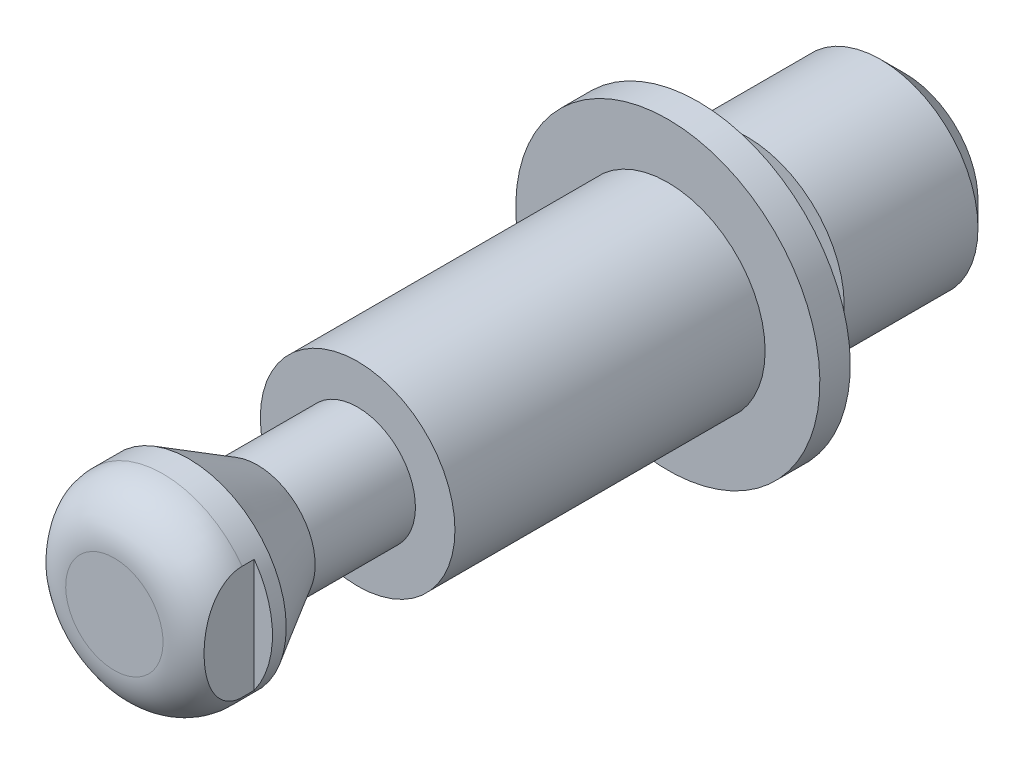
ISO-10303-21;
HEADER;
FILE_DESCRIPTION(('STEP AP214'),'2;1');
FILE_NAME('part.step','',(''),(''),'','','');
FILE_SCHEMA(('AUTOMOTIVE_DESIGN { 1 0 10303 214 1 1 1 1 }'));
ENDSEC;
DATA;
#1=APPLICATION_CONTEXT('core data for automotive mechanical design processes');
#2=APPLICATION_PROTOCOL_DEFINITION('international standard','automotive_design',2000,#1);
#3=PRODUCT_CONTEXT('',#1,'mechanical');
#4=PRODUCT('Part','Part','',(#3));
#5=PRODUCT_RELATED_PRODUCT_CATEGORY('part','',(#4));
#6=PRODUCT_DEFINITION_FORMATION('','',#4);
#7=PRODUCT_DEFINITION_CONTEXT('part definition',#1,'design');
#8=PRODUCT_DEFINITION('design','',#6,#7);
#9=PRODUCT_DEFINITION_SHAPE('','',#8);
#10=(LENGTH_UNIT() NAMED_UNIT(*) SI_UNIT(.MILLI.,.METRE.));
#11=(NAMED_UNIT(*) PLANE_ANGLE_UNIT() SI_UNIT($,.RADIAN.));
#12=(NAMED_UNIT(*) SI_UNIT($,.STERADIAN.) SOLID_ANGLE_UNIT());
#13=UNCERTAINTY_MEASURE_WITH_UNIT(LENGTH_MEASURE(1.E-05),#10,'distance_accuracy_value','');
#14=(GEOMETRIC_REPRESENTATION_CONTEXT(3) GLOBAL_UNCERTAINTY_ASSIGNED_CONTEXT((#13)) GLOBAL_UNIT_ASSIGNED_CONTEXT((#10,
#11,#12)) REPRESENTATION_CONTEXT('',''));
#15=CARTESIAN_POINT('',(0.,0.,0.));
#16=DIRECTION('',(0.,0.,1.));
#17=DIRECTION('',(1.,0.,0.));
#18=AXIS2_PLACEMENT_3D('',#15,#16,#17);
#19=CARTESIAN_POINT('',(0.,0.,0.));
#20=DIRECTION('',(0.,0.,-1.));
#21=DIRECTION('',(0.,-1.,0.));
#22=AXIS2_PLACEMENT_3D('',#19,#20,#21);
#23=PLANE('',#22);
#24=CARTESIAN_POINT('',(0.,0.,0.));
#25=DIRECTION('',(0.,0.,-1.));
#26=DIRECTION('',(-1.,0.,0.));
#27=AXIS2_PLACEMENT_3D('',#24,#25,#26);
#28=CIRCLE('',#27,6.5);
#29=CARTESIAN_POINT('',(-6.5,0.,0.));
#30=VERTEX_POINT('',#29);
#31=EDGE_CURVE('E82',#30,#30,#28,.T.);
#32=ORIENTED_EDGE('',*,*,#31,.F.);
#33=EDGE_LOOP('',(#32));
#34=FACE_BOUND('',#33,.T.);
#35=CARTESIAN_POINT('',(0.,0.,0.));
#36=DIRECTION('',(0.,0.,1.));
#37=DIRECTION('',(0.,1.,0.));
#38=AXIS2_PLACEMENT_3D('',#35,#36,#37);
#39=CIRCLE('',#38,12.5);
#40=CARTESIAN_POINT('',(0.,12.5,0.));
#41=VERTEX_POINT('',#40);
#42=EDGE_CURVE('E107',#41,#41,#39,.T.);
#43=ORIENTED_EDGE('',*,*,#42,.F.);
#44=EDGE_LOOP('',(#43));
#45=FACE_BOUND('',#44,.T.);
#46=ADVANCED_FACE('F14',(#34,#45),#23,.T.);
#47=CARTESIAN_POINT('',(0.,0.,0.));
#48=DIRECTION('',(0.,0.,1.));
#49=DIRECTION('',(0.,1.,0.));
#50=AXIS2_PLACEMENT_3D('',#47,#48,#49);
#51=CYLINDRICAL_SURFACE('',#50,12.5);
#52=ORIENTED_EDGE('',*,*,#42,.T.);
#53=EDGE_LOOP('',(#52));
#54=FACE_BOUND('',#53,.T.);
#55=CARTESIAN_POINT('',(0.,0.,2.5));
#56=DIRECTION('',(0.,0.,1.));
#57=DIRECTION('',(0.,1.,0.));
#58=AXIS2_PLACEMENT_3D('',#55,#56,#57);
#59=CIRCLE('',#58,12.5);
#60=CARTESIAN_POINT('',(0.,12.5,2.5));
#61=VERTEX_POINT('',#60);
#62=EDGE_CURVE('E104',#61,#61,#59,.T.);
#63=ORIENTED_EDGE('',*,*,#62,.F.);
#64=EDGE_LOOP('',(#63));
#65=FACE_BOUND('',#64,.T.);
#66=ADVANCED_FACE('F157',(#54,#65),#51,.T.);
#67=CARTESIAN_POINT('',(0.,12.5,2.5));
#68=DIRECTION('',(0.,0.,1.));
#69=DIRECTION('',(0.,1.,0.));
#70=AXIS2_PLACEMENT_3D('',#67,#68,#69);
#71=PLANE('',#70);
#72=ORIENTED_EDGE('',*,*,#62,.T.);
#73=EDGE_LOOP('',(#72));
#74=FACE_BOUND('',#73,.T.);
#75=CARTESIAN_POINT('',(0.,0.,2.5));
#76=DIRECTION('',(0.,0.,1.));
#77=DIRECTION('',(0.,1.,0.));
#78=AXIS2_PLACEMENT_3D('',#75,#76,#77);
#79=CIRCLE('',#78,8.);
#80=CARTESIAN_POINT('',(0.,8.,2.5));
#81=VERTEX_POINT('',#80);
#82=EDGE_CURVE('E101',#81,#81,#79,.T.);
#83=ORIENTED_EDGE('',*,*,#82,.F.);
#84=EDGE_LOOP('',(#83));
#85=FACE_BOUND('',#84,.T.);
#86=ADVANCED_FACE('F163',(#74,#85),#71,.T.);
#87=CARTESIAN_POINT('',(0.,0.,0.));
#88=DIRECTION('',(0.,0.,1.));
#89=DIRECTION('',(0.,1.,0.));
#90=AXIS2_PLACEMENT_3D('',#87,#88,#89);
#91=CYLINDRICAL_SURFACE('',#90,8.);
#92=ORIENTED_EDGE('',*,*,#82,.T.);
#93=EDGE_LOOP('',(#92));
#94=FACE_BOUND('',#93,.T.);
#95=CARTESIAN_POINT('',(0.,0.,28.));
#96=DIRECTION('',(0.,0.,1.));
#97=DIRECTION('',(0.,1.,0.));
#98=AXIS2_PLACEMENT_3D('',#95,#96,#97);
#99=CIRCLE('',#98,8.);
#100=CARTESIAN_POINT('',(0.,8.,28.));
#101=VERTEX_POINT('',#100);
#102=EDGE_CURVE('E98',#101,#101,#99,.T.);
#103=ORIENTED_EDGE('',*,*,#102,.F.);
#104=EDGE_LOOP('',(#103));
#105=FACE_BOUND('',#104,.T.);
#106=ADVANCED_FACE('F171',(#94,#105),#91,.T.);
#107=CARTESIAN_POINT('',(0.,4.75,28.));
#108=DIRECTION('',(0.,0.,1.));
#109=DIRECTION('',(0.,1.,0.));
#110=AXIS2_PLACEMENT_3D('',#107,#108,#109);
#111=PLANE('',#110);
#112=ORIENTED_EDGE('',*,*,#102,.T.);
#113=EDGE_LOOP('',(#112));
#114=FACE_BOUND('',#113,.T.);
#115=CARTESIAN_POINT('',(0.,0.,28.));
#116=DIRECTION('',(0.,0.,1.));
#117=DIRECTION('',(0.,1.,0.));
#118=AXIS2_PLACEMENT_3D('',#115,#116,#117);
#119=CIRCLE('',#118,4.75);
#120=CARTESIAN_POINT('',(0.,4.75,28.));
#121=VERTEX_POINT('',#120);
#122=EDGE_CURVE('E95',#121,#121,#119,.T.);
#123=ORIENTED_EDGE('',*,*,#122,.F.);
#124=EDGE_LOOP('',(#123));
#125=FACE_BOUND('',#124,.T.);
#126=ADVANCED_FACE('F175',(#114,#125),#111,.T.);
#127=CARTESIAN_POINT('',(0.,0.,0.));
#128=DIRECTION('',(0.,0.,1.));
#129=DIRECTION('',(0.,1.,0.));
#130=AXIS2_PLACEMENT_3D('',#127,#128,#129);
#131=CYLINDRICAL_SURFACE('',#130,4.75);
#132=ORIENTED_EDGE('',*,*,#122,.T.);
#133=EDGE_LOOP('',(#132));
#134=FACE_BOUND('',#133,.T.);
#135=CARTESIAN_POINT('',(0.,0.,36.24));
#136=DIRECTION('',(0.,0.,1.));
#137=DIRECTION('',(0.,1.,0.));
#138=AXIS2_PLACEMENT_3D('',#135,#136,#137);
#139=CIRCLE('',#138,4.75);
#140=CARTESIAN_POINT('',(0.,4.75,36.24));
#141=VERTEX_POINT('',#140);
#142=EDGE_CURVE('E92',#141,#141,#139,.T.);
#143=ORIENTED_EDGE('',*,*,#142,.F.);
#144=EDGE_LOOP('',(#143));
#145=FACE_BOUND('',#144,.T.);
#146=ADVANCED_FACE('F179',(#134,#145),#131,.T.);
#147=CARTESIAN_POINT('',(0.,0.,41.8691651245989));
#148=DIRECTION('',(0.,0.,1.));
#149=DIRECTION('',(0.,1.,0.));
#150=AXIS2_PLACEMENT_3D('',#147,#148,#149);
#151=CONICAL_SURFACE('',#150,8.,0.5235987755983);
#152=ORIENTED_EDGE('',*,*,#142,.T.);
#153=EDGE_LOOP('',(#152));
#154=FACE_BOUND('',#153,.T.);
#155=CARTESIAN_POINT('',(0.,0.,41.8691651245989));
#156=DIRECTION('',(0.,0.,1.));
#157=DIRECTION('',(0.,1.,0.));
#158=AXIS2_PLACEMENT_3D('',#155,#156,#157);
#159=CIRCLE('',#158,8.);
#160=CARTESIAN_POINT('',(0.,8.,41.8691651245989));
#161=VERTEX_POINT('',#160);
#162=EDGE_CURVE('E89',#161,#161,#159,.T.);
#163=ORIENTED_EDGE('',*,*,#162,.F.);
#164=EDGE_LOOP('',(#163));
#165=FACE_BOUND('',#164,.T.);
#166=ADVANCED_FACE('F183',(#154,#165),#151,.T.);
#167=CARTESIAN_POINT('',(0.,0.,0.));
#168=DIRECTION('',(0.,0.,1.));
#169=DIRECTION('',(0.,1.,0.));
#170=AXIS2_PLACEMENT_3D('',#167,#168,#169);
#171=CYLINDRICAL_SURFACE('',#170,8.);
#172=DIRECTION('',(0.,0.,1.));
#173=VECTOR('',#172,1.);
#174=CARTESIAN_POINT('',(-6.5,4.66368952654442,0.));
#175=LINE('',#174,#173);
#176=CARTESIAN_POINT('',(-6.5,4.66368952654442,44.));
#177=VERTEX_POINT('',#176);
#178=CARTESIAN_POINT('',(-6.5,4.66368952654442,43.));
#179=VERTEX_POINT('',#178);
#180=EDGE_CURVE('E64',#177,#179,#175,.F.);
#181=ORIENTED_EDGE('',*,*,#180,.F.);
#182=CARTESIAN_POINT('',(0.,0.,44.));
#183=DIRECTION('',(0.,0.,1.));
#184=DIRECTION('',(0.,1.,0.));
#185=AXIS2_PLACEMENT_3D('',#182,#183,#184);
#186=CIRCLE('',#185,8.);
#187=CARTESIAN_POINT('',(6.5,4.66368952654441,44.));
#188=VERTEX_POINT('',#187);
#189=EDGE_CURVE('E37',#177,#188,#186,.F.);
#190=ORIENTED_EDGE('',*,*,#189,.T.);
#191=DIRECTION('',(0.,0.,1.));
#192=VECTOR('',#191,1.);
#193=CARTESIAN_POINT('',(6.5,4.66368952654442,0.));
#194=LINE('',#193,#192);
#195=CARTESIAN_POINT('',(6.5,4.66368952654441,43.));
#196=VERTEX_POINT('',#195);
#197=EDGE_CURVE('E78',#196,#188,#194,.T.);
#198=ORIENTED_EDGE('',*,*,#197,.F.);
#199=CARTESIAN_POINT('',(0.,0.,43.));
#200=DIRECTION('',(0.,0.,-1.));
#201=DIRECTION('',(-1.,0.,0.));
#202=AXIS2_PLACEMENT_3D('',#199,#200,#201);
#203=CIRCLE('',#202,8.);
#204=CARTESIAN_POINT('',(6.5,-4.66368952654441,43.));
#205=VERTEX_POINT('',#204);
#206=EDGE_CURVE('E123',#205,#196,#203,.F.);
#207=ORIENTED_EDGE('',*,*,#206,.F.);
#208=DIRECTION('',(0.,0.,1.));
#209=VECTOR('',#208,1.);
#210=CARTESIAN_POINT('',(6.5,-4.66368952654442,0.));
#211=LINE('',#210,#209);
#212=CARTESIAN_POINT('',(6.5,-4.66368952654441,44.));
#213=VERTEX_POINT('',#212);
#214=EDGE_CURVE('E80',#213,#205,#211,.F.);
#215=ORIENTED_EDGE('',*,*,#214,.F.);
#216=CARTESIAN_POINT('',(-6.5,-4.66368952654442,44.));
#217=VERTEX_POINT('',#216);
#218=EDGE_CURVE('E71',#213,#217,#186,.F.);
#219=ORIENTED_EDGE('',*,*,#218,.T.);
#220=DIRECTION('',(0.,0.,1.));
#221=VECTOR('',#220,1.);
#222=CARTESIAN_POINT('',(-6.5,-4.66368952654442,0.));
#223=LINE('',#222,#221);
#224=CARTESIAN_POINT('',(-6.5,-4.66368952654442,43.));
#225=VERTEX_POINT('',#224);
#226=EDGE_CURVE('E29',#225,#217,#223,.T.);
#227=ORIENTED_EDGE('',*,*,#226,.F.);
#228=CARTESIAN_POINT('',(0.,0.,43.));
#229=DIRECTION('',(0.,0.,-1.));
#230=DIRECTION('',(-1.,0.,0.));
#231=AXIS2_PLACEMENT_3D('',#228,#229,#230);
#232=CIRCLE('',#231,8.);
#233=EDGE_CURVE('E58',#179,#225,#232,.F.);
#234=ORIENTED_EDGE('',*,*,#233,.F.);
#235=EDGE_LOOP('',(#181,#190,#198,#207,#215,#219,#227,#234));
#236=FACE_BOUND('',#235,.T.);
#237=ORIENTED_EDGE('',*,*,#162,.T.);
#238=EDGE_LOOP('',(#237));
#239=FACE_BOUND('',#238,.T.);
#240=ADVANCED_FACE('F67',(#236,#239),#171,.T.);
#241=CARTESIAN_POINT('',(0.,0.,48.));
#242=DIRECTION('',(0.,0.,1.));
#243=DIRECTION('',(0.,1.,0.));
#244=AXIS2_PLACEMENT_3D('',#241,#242,#243);
#245=PLANE('',#244);
#246=CARTESIAN_POINT('',(0.,0.,48.));
#247=DIRECTION('',(0.,0.,1.));
#248=DIRECTION('',(0.,1.,0.));
#249=AXIS2_PLACEMENT_3D('',#246,#247,#248);
#250=CIRCLE('',#249,4.);
#251=CARTESIAN_POINT('',(0.,4.,48.));
#252=VERTEX_POINT('',#251);
#253=EDGE_CURVE('E110',#252,#252,#250,.T.);
#254=ORIENTED_EDGE('',*,*,#253,.T.);
#255=EDGE_LOOP('',(#254));
#256=FACE_BOUND('',#255,.T.);
#257=ADVANCED_FACE('F189',(#256),#245,.T.);
#258=CARTESIAN_POINT('',(0.,0.,44.));
#259=DIRECTION('',(0.,0.,1.));
#260=DIRECTION('',(0.,1.,0.));
#261=AXIS2_PLACEMENT_3D('',#258,#259,#260);
#262=DEGENERATE_TOROIDAL_SURFACE('',#261,4.,4.,.T.);
#263=CARTESIAN_POINT('',(-6.5,0.,47.1224989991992));
#264=CARTESIAN_POINT('',(-6.5,0.206844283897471,47.1225044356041));
#265=CARTESIAN_POINT('',(-6.5,0.413723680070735,47.1146377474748));
#266=CARTESIAN_POINT('',(-6.5,0.82639294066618,47.0826488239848));
#267=CARTESIAN_POINT('',(-6.5,1.03218184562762,47.0585141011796));
#268=CARTESIAN_POINT('',(-6.5,1.44076522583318,46.9924737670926));
#269=CARTESIAN_POINT('',(-6.5,1.64356226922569,46.9505844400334));
#270=CARTESIAN_POINT('',(-6.5,2.04379599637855,46.8467158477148));
#271=CARTESIAN_POINT('',(-6.5,2.24123900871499,46.7847615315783));
#272=CARTESIAN_POINT('',(-6.5,2.6257340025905,46.6384856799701));
#273=CARTESIAN_POINT('',(-6.5,2.81286529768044,46.5543766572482));
#274=CARTESIAN_POINT('',(-6.5,3.17339855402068,46.3606787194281));
#275=CARTESIAN_POINT('',(-6.5,3.34682225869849,46.2511312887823));
#276=CARTESIAN_POINT('',(-6.5,3.64791360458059,46.0234028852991));
#277=CARTESIAN_POINT('',(-6.5,3.77851688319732,45.9091377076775));
#278=CARTESIAN_POINT('',(-6.5,4.01931634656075,45.6606747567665));
#279=CARTESIAN_POINT('',(-6.5,4.12953184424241,45.5264960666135));
#280=CARTESIAN_POINT('',(-6.5,4.30622665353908,45.2651657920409));
#281=CARTESIAN_POINT('',(-6.5,4.37698745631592,45.1409173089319));
#282=CARTESIAN_POINT('',(-6.5,4.49686600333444,44.8823333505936));
#283=CARTESIAN_POINT('',(-6.5,4.5459944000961,44.7480028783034));
#284=CARTESIAN_POINT('',(-6.5,4.61991783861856,44.4720985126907));
#285=CARTESIAN_POINT('',(-6.5,4.64460389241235,44.3304951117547));
#286=CARTESIAN_POINT('',(-6.5,4.66762977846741,44.0451551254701));
#287=CARTESIAN_POINT('',(-6.5,4.66597507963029,43.9014189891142));
#288=CARTESIAN_POINT('',(-6.5,4.63759258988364,43.6275896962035));
#289=CARTESIAN_POINT('',(-6.5,4.61278528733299,43.497291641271));
#290=CARTESIAN_POINT('',(-6.5,4.54221558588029,43.2425527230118));
#291=CARTESIAN_POINT('',(-6.5,4.49645377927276,43.1181116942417));
#292=CARTESIAN_POINT('',(-6.5,4.38471293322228,42.8744777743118));
#293=CARTESIAN_POINT('',(-6.5,4.3182015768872,42.7555308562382));
#294=CARTESIAN_POINT('',(-6.5,4.16847613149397,42.5287171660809));
#295=CARTESIAN_POINT('',(-6.5,4.08525303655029,42.4208564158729));
#296=CARTESIAN_POINT('',(-6.5,3.86724260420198,42.1743794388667));
#297=CARTESIAN_POINT('',(-6.5,3.72548986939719,42.0419084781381));
#298=CARTESIAN_POINT('',(-6.5,3.42247196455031,41.8017298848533));
#299=CARTESIAN_POINT('',(-6.5,3.26117323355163,41.694065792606));
#300=CARTESIAN_POINT('',(-6.5,2.85157841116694,41.4597006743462));
#301=CARTESIAN_POINT('',(-6.5,2.59618561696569,41.3454046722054));
#302=CARTESIAN_POINT('',(-6.5,2.20250582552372,41.2046974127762));
#303=CARTESIAN_POINT('',(-6.5,2.06925974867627,41.1628694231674));
#304=CARTESIAN_POINT('',(-6.5,1.80017257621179,41.0885796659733));
#305=CARTESIAN_POINT('',(-6.5,1.66433200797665,41.0561160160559));
#306=CARTESIAN_POINT('',(-6.5,1.31769188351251,40.9846693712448));
#307=CARTESIAN_POINT('',(-6.5,1.10569583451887,40.9515006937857));
#308=CARTESIAN_POINT('',(-6.5,0.679590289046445,40.9031779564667));
#309=CARTESIAN_POINT('',(-6.5,0.46547946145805,40.8880360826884));
#310=CARTESIAN_POINT('',(-6.5,0.0366429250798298,40.8747393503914));
#311=CARTESIAN_POINT('',(-6.5,-0.178083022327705,40.8765923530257));
#312=CARTESIAN_POINT('',(-6.5,-0.606616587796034,40.8974276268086));
#313=CARTESIAN_POINT('',(-6.5,-0.820424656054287,40.916400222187));
#314=CARTESIAN_POINT('',(-6.5,-1.17885367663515,40.9639438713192));
#315=CARTESIAN_POINT('',(-6.5,-1.32412214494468,40.9876315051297));
#316=CARTESIAN_POINT('',(-6.5,-1.61280135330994,41.0444174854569));
#317=CARTESIAN_POINT('',(-6.5,-1.75621171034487,41.0775177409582));
#318=CARTESIAN_POINT('',(-6.5,-2.18162996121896,41.1921142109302));
#319=CARTESIAN_POINT('',(-6.5,-2.45990046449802,41.2890344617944));
#320=CARTESIAN_POINT('',(-6.5,-2.91255534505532,41.495243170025));
#321=CARTESIAN_POINT('',(-6.5,-3.0927504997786,41.591755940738));
#322=CARTESIAN_POINT('',(-6.5,-3.43630632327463,41.8114221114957));
#323=CARTESIAN_POINT('',(-6.5,-3.5996865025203,41.9345441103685));
#324=CARTESIAN_POINT('',(-6.5,-3.86958100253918,42.1796574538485));
#325=CARTESIAN_POINT('',(-6.5,-3.98082292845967,42.2964174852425));
#326=CARTESIAN_POINT('',(-6.5,-4.18285712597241,42.5466212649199));
#327=CARTESIAN_POINT('',(-6.5,-4.27365703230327,42.680058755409));
#328=CARTESIAN_POINT('',(-6.5,-4.43031907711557,42.9625461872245));
#329=CARTESIAN_POINT('',(-6.5,-4.49595824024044,43.1117214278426));
#330=CARTESIAN_POINT('',(-6.5,-4.59638438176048,43.4201427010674));
#331=CARTESIAN_POINT('',(-6.5,-4.6311999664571,43.5793792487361));
#332=CARTESIAN_POINT('',(-6.5,-4.66465778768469,43.8785289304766));
#333=CARTESIAN_POINT('',(-6.5,-4.66775361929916,44.0179563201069));
#334=CARTESIAN_POINT('',(-6.5,-4.64910977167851,44.2951083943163));
#335=CARTESIAN_POINT('',(-6.5,-4.62737796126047,44.4328336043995));
#336=CARTESIAN_POINT('',(-6.5,-4.56215114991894,44.6954954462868));
#337=CARTESIAN_POINT('',(-6.5,-4.51982148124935,44.8207261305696));
#338=CARTESIAN_POINT('',(-6.5,-4.41619392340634,45.0630239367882));
#339=CARTESIAN_POINT('',(-6.5,-4.35489293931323,45.1800897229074));
#340=CARTESIAN_POINT('',(-6.5,-4.21068385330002,45.4126534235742));
#341=CARTESIAN_POINT('',(-6.5,-4.1264793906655,45.5273428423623));
#342=CARTESIAN_POINT('',(-6.5,-3.94276231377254,45.7436183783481));
#343=CARTESIAN_POINT('',(-6.5,-3.84324302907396,45.8451987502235));
#344=CARTESIAN_POINT('',(-6.5,-3.57704737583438,46.084438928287));
#345=CARTESIAN_POINT('',(-6.5,-3.40242327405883,46.2132706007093));
#346=CARTESIAN_POINT('',(-6.5,-3.03468146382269,46.4414535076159));
#347=CARTESIAN_POINT('',(-6.5,-2.84151094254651,46.5407170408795));
#348=CARTESIAN_POINT('',(-6.5,-2.49271952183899,46.6915848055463));
#349=CARTESIAN_POINT('',(-6.5,-2.33950097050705,46.7489071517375));
#350=CARTESIAN_POINT('',(-6.5,-2.02857752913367,46.8499832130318));
#351=CARTESIAN_POINT('',(-6.5,-1.87086988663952,46.8937283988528));
#352=CARTESIAN_POINT('',(-6.5,-1.55268949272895,46.9689599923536));
#353=CARTESIAN_POINT('',(-6.5,-1.39221817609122,47.0004525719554));
#354=CARTESIAN_POINT('',(-6.5,-1.06957427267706,47.0523335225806));
#355=CARTESIAN_POINT('',(-6.5,-0.907402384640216,47.0727262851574));
#356=CARTESIAN_POINT('',(-6.5,-0.62102426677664,47.0995656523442));
#357=CARTESIAN_POINT('',(-6.5,-0.497014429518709,47.1081812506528));
#358=CARTESIAN_POINT('',(-6.5,-0.248674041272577,47.1196476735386));
#359=CARTESIAN_POINT('',(-6.5,-0.12434336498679,47.1224957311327));
#360=CARTESIAN_POINT('',(-6.5,0.,47.1224989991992));
#361=B_SPLINE_CURVE_WITH_KNOTS('',3,(#263,#264,#265,#266,#267,#268,#269,#270,#271,#272,#273,
#274,#275,#276,#277,#278,#279,#280,#281,#282,#283,#284,#285,#286,#287,#288,#289,#290,#291,#292,
#293,#294,#295,#296,#297,#298,#299,#300,#301,#302,#303,#304,#305,#306,#307,#308,#309,#310,#311,
#312,#313,#314,#315,#316,#317,#318,#319,#320,#321,#322,#323,#324,#325,#326,#327,#328,#329,#330,
#331,#332,#333,#334,#335,#336,#337,#338,#339,#340,#341,#342,#343,#344,#345,#346,#347,#348,#349,
#350,#351,#352,#353,#354,#355,#356,#357,#358,#359,#360),.UNSPECIFIED.,.T.,.F.,(4,2,2,2,2,2,2,2,
2,2,2,2,2,2,2,2,2,2,2,2,2,2,2,2,2,2,2,2,2,2,2,2,2,2,2,2,2,2,2,2,2,2,2,2,2,2,2,2,4),(0.,
0.620437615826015,1.24135202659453,1.86169817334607,2.48127591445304,3.09511426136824,
3.70795851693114,4.22659549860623,4.74473864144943,5.17190085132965,5.59885247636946,
6.02769941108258,6.456457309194,6.85253859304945,7.2486086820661,7.65581612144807,
8.06324359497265,8.6420349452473,9.22183456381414,10.0562668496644,10.4750231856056,
10.8936952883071,11.5365091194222,12.1797572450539,12.8233029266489,13.466485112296,
13.9077415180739,14.3490874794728,15.2285544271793,15.8399392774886,16.4506065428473,
16.9325628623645,17.4143388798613,17.9002907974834,18.3857912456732,18.8019993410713,
19.2180755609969,19.6129512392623,20.0078913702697,20.4331144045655,20.8585231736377,
21.5058893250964,22.1551569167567,22.6452750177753,23.1357003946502,23.6258784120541,
24.1158623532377,24.4886563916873,24.8616292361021),.UNSPECIFIED.);
#362=EDGE_CURVE('E61',#217,#177,#361,.T.);
#363=ORIENTED_EDGE('',*,*,#362,.F.);
#364=ORIENTED_EDGE('',*,*,#218,.F.);
#365=CARTESIAN_POINT('',(6.5,0.,47.1224989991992));
#366=CARTESIAN_POINT('',(6.5,-0.20684428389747,47.1225044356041));
#367=CARTESIAN_POINT('',(6.5,-0.413723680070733,47.1146377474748));
#368=CARTESIAN_POINT('',(6.5,-0.826392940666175,47.0826488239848));
#369=CARTESIAN_POINT('',(6.5,-1.03218184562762,47.0585141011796));
#370=CARTESIAN_POINT('',(6.5,-1.44076522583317,46.9924737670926));
#371=CARTESIAN_POINT('',(6.5,-1.64356226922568,46.9505844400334));
#372=CARTESIAN_POINT('',(6.5,-2.04379599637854,46.8467158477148));
#373=CARTESIAN_POINT('',(6.5,-2.24123900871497,46.7847615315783));
#374=CARTESIAN_POINT('',(6.5,-2.62573400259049,46.6384856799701));
#375=CARTESIAN_POINT('',(6.5,-2.81286529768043,46.5543766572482));
#376=CARTESIAN_POINT('',(6.5,-3.17339855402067,46.3606787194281));
#377=CARTESIAN_POINT('',(6.5,-3.34682225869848,46.2511312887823));
#378=CARTESIAN_POINT('',(6.5,-3.64791360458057,46.0234028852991));
#379=CARTESIAN_POINT('',(6.5,-3.77851688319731,45.9091377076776));
#380=CARTESIAN_POINT('',(6.5,-4.01931634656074,45.6606747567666));
#381=CARTESIAN_POINT('',(6.5,-4.1295318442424,45.5264960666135));
#382=CARTESIAN_POINT('',(6.5,-4.30622665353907,45.2651657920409));
#383=CARTESIAN_POINT('',(6.5,-4.37698745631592,45.1409173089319));
#384=CARTESIAN_POINT('',(6.5,-4.49686600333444,44.8823333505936));
#385=CARTESIAN_POINT('',(6.5,-4.54599440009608,44.7480028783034));
#386=CARTESIAN_POINT('',(6.5,-4.61991783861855,44.4720985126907));
#387=CARTESIAN_POINT('',(6.5,-4.64460389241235,44.3304951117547));
#388=CARTESIAN_POINT('',(6.5,-4.66762977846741,44.0451551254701));
#389=CARTESIAN_POINT('',(6.5,-4.66597507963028,43.9014189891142));
#390=CARTESIAN_POINT('',(6.5,-4.63759258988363,43.6275896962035));
#391=CARTESIAN_POINT('',(6.5,-4.61278528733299,43.497291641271));
#392=CARTESIAN_POINT('',(6.5,-4.54221558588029,43.2425527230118));
#393=CARTESIAN_POINT('',(6.5,-4.49645377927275,43.1181116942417));
#394=CARTESIAN_POINT('',(6.5,-4.38471293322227,42.8744777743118));
#395=CARTESIAN_POINT('',(6.5,-4.31820157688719,42.7555308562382));
#396=CARTESIAN_POINT('',(6.5,-4.16847613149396,42.5287171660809));
#397=CARTESIAN_POINT('',(6.5,-4.08525303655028,42.4208564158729));
#398=CARTESIAN_POINT('',(6.5,-3.86724260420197,42.1743794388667));
#399=CARTESIAN_POINT('',(6.5,-3.72548986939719,42.0419084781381));
#400=CARTESIAN_POINT('',(6.5,-3.4224719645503,41.8017298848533));
#401=CARTESIAN_POINT('',(6.5,-3.26117323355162,41.694065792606));
#402=CARTESIAN_POINT('',(6.5,-2.85157841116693,41.4597006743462));
#403=CARTESIAN_POINT('',(6.5,-2.59618561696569,41.3454046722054));
#404=CARTESIAN_POINT('',(6.5,-2.20250582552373,41.2046974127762));
#405=CARTESIAN_POINT('',(6.5,-2.06925974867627,41.1628694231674));
#406=CARTESIAN_POINT('',(6.5,-1.80017257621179,41.0885796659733));
#407=CARTESIAN_POINT('',(6.5,-1.66433200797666,41.0561160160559));
#408=CARTESIAN_POINT('',(6.5,-1.31769188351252,40.9846693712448));
#409=CARTESIAN_POINT('',(6.5,-1.10569583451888,40.9515006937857));
#410=CARTESIAN_POINT('',(6.5,-0.679590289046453,40.9031779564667));
#411=CARTESIAN_POINT('',(6.5,-0.465479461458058,40.8880360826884));
#412=CARTESIAN_POINT('',(6.5,-0.0366429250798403,40.8747393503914));
#413=CARTESIAN_POINT('',(6.5,0.178083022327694,40.8765923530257));
#414=CARTESIAN_POINT('',(6.5,0.606616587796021,40.8974276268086));
#415=CARTESIAN_POINT('',(6.5,0.820424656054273,40.916400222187));
#416=CARTESIAN_POINT('',(6.5,1.17885367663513,40.9639438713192));
#417=CARTESIAN_POINT('',(6.5,1.32412214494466,40.9876315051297));
#418=CARTESIAN_POINT('',(6.5,1.61280135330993,41.0444174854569));
#419=CARTESIAN_POINT('',(6.5,1.75621171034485,41.0775177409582));
#420=CARTESIAN_POINT('',(6.5,2.18162996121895,41.1921142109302));
#421=CARTESIAN_POINT('',(6.5,2.459900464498,41.2890344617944));
#422=CARTESIAN_POINT('',(6.5,2.91255534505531,41.4952431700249));
#423=CARTESIAN_POINT('',(6.5,3.09275049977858,41.5917559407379));
#424=CARTESIAN_POINT('',(6.5,3.43630632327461,41.8114221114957));
#425=CARTESIAN_POINT('',(6.5,3.59968650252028,41.9345441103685));
#426=CARTESIAN_POINT('',(6.5,3.86958100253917,42.1796574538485));
#427=CARTESIAN_POINT('',(6.5,3.98082292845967,42.2964174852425));
#428=CARTESIAN_POINT('',(6.5,4.18285712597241,42.5466212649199));
#429=CARTESIAN_POINT('',(6.5,4.27365703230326,42.680058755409));
#430=CARTESIAN_POINT('',(6.5,4.43031907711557,42.9625461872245));
#431=CARTESIAN_POINT('',(6.5,4.49595824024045,43.1117214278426));
#432=CARTESIAN_POINT('',(6.5,4.59638438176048,43.4201427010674));
#433=CARTESIAN_POINT('',(6.5,4.63119996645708,43.5793792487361));
#434=CARTESIAN_POINT('',(6.5,4.66465778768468,43.8785289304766));
#435=CARTESIAN_POINT('',(6.5,4.66775361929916,44.0179563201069));
#436=CARTESIAN_POINT('',(6.5,4.64910977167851,44.2951083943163));
#437=CARTESIAN_POINT('',(6.5,4.62737796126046,44.4328336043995));
#438=CARTESIAN_POINT('',(6.5,4.56215114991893,44.6954954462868));
#439=CARTESIAN_POINT('',(6.5,4.51982148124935,44.8207261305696));
#440=CARTESIAN_POINT('',(6.5,4.41619392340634,45.0630239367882));
#441=CARTESIAN_POINT('',(6.5,4.35489293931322,45.1800897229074));
#442=CARTESIAN_POINT('',(6.5,4.2106838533,45.4126534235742));
#443=CARTESIAN_POINT('',(6.5,4.12647939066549,45.5273428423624));
#444=CARTESIAN_POINT('',(6.5,3.94276231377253,45.7436183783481));
#445=CARTESIAN_POINT('',(6.5,3.84324302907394,45.8451987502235));
#446=CARTESIAN_POINT('',(6.5,3.57704737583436,46.084438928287));
#447=CARTESIAN_POINT('',(6.5,3.40242327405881,46.2132706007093));
#448=CARTESIAN_POINT('',(6.5,3.03468146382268,46.4414535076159));
#449=CARTESIAN_POINT('',(6.5,2.8415109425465,46.5407170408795));
#450=CARTESIAN_POINT('',(6.5,2.49271952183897,46.6915848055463));
#451=CARTESIAN_POINT('',(6.5,2.33950097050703,46.7489071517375));
#452=CARTESIAN_POINT('',(6.5,2.02857752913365,46.8499832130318));
#453=CARTESIAN_POINT('',(6.5,1.8708698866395,46.8937283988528));
#454=CARTESIAN_POINT('',(6.5,1.55268949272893,46.9689599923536));
#455=CARTESIAN_POINT('',(6.5,1.3922181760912,47.0004525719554));
#456=CARTESIAN_POINT('',(6.5,1.06957427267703,47.0523335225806));
#457=CARTESIAN_POINT('',(6.5,0.907402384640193,47.0727262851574));
#458=CARTESIAN_POINT('',(6.5,0.621024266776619,47.0995656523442));
#459=CARTESIAN_POINT('',(6.5,0.497014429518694,47.1081812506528));
#460=CARTESIAN_POINT('',(6.5,0.24867404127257,47.1196476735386));
#461=CARTESIAN_POINT('',(6.5,0.124343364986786,47.1224957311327));
#462=CARTESIAN_POINT('',(6.5,0.,47.1224989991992));
#463=B_SPLINE_CURVE_WITH_KNOTS('',3,(#365,#366,#367,#368,#369,#370,#371,#372,#373,#374,#375,
#376,#377,#378,#379,#380,#381,#382,#383,#384,#385,#386,#387,#388,#389,#390,#391,#392,#393,#394,
#395,#396,#397,#398,#399,#400,#401,#402,#403,#404,#405,#406,#407,#408,#409,#410,#411,#412,#413,
#414,#415,#416,#417,#418,#419,#420,#421,#422,#423,#424,#425,#426,#427,#428,#429,#430,#431,#432,
#433,#434,#435,#436,#437,#438,#439,#440,#441,#442,#443,#444,#445,#446,#447,#448,#449,#450,#451,
#452,#453,#454,#455,#456,#457,#458,#459,#460,#461,#462),.UNSPECIFIED.,.T.,.F.,(4,2,2,2,2,2,2,2,
2,2,2,2,2,2,2,2,2,2,2,2,2,2,2,2,2,2,2,2,2,2,2,2,2,2,2,2,2,2,2,2,2,2,2,2,2,2,2,2,4),(0.,
0.620437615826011,1.24135202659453,1.86169817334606,2.48127591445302,3.09511426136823,
3.70795851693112,4.22659549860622,4.74473864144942,5.17190085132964,5.59885247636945,
6.02769941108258,6.456457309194,6.85253859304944,7.2486086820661,7.65581612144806,
8.06324359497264,8.64203494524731,9.22183456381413,10.0562668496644,10.4750231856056,
10.8936952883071,11.5365091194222,12.1797572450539,12.8233029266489,13.466485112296,
13.9077415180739,14.3490874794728,15.2285544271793,15.8399392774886,16.4506065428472,
16.9325628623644,17.4143388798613,17.9002907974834,18.3857912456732,18.8019993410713,
19.2180755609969,19.6129512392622,20.0078913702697,20.4331144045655,20.8585231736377,
21.5058893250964,22.1551569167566,22.6452750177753,23.1357003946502,23.625878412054,
24.1158623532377,24.4886563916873,24.8616292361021),.UNSPECIFIED.);
#464=EDGE_CURVE('E114',#188,#213,#463,.T.);
#465=ORIENTED_EDGE('',*,*,#464,.F.);
#466=ORIENTED_EDGE('',*,*,#189,.F.);
#467=EDGE_LOOP('',(#363,#364,#465,#466));
#468=FACE_BOUND('',#467,.T.);
#469=ORIENTED_EDGE('',*,*,#253,.F.);
#470=EDGE_LOOP('',(#469));
#471=FACE_BOUND('',#470,.T.);
#472=ADVANCED_FACE('F125',(#468,#471),#262,.T.);
#473=CARTESIAN_POINT('',(0.,6.5,-4.));
#474=DIRECTION('',(0.,0.,1.));
#475=DIRECTION('',(1.,0.,0.));
#476=AXIS2_PLACEMENT_3D('',#473,#474,#475);
#477=PLANE('',#476);
#478=CARTESIAN_POINT('',(0.,0.,-4.));
#479=DIRECTION('',(0.,0.,-1.));
#480=DIRECTION('',(-1.,0.,0.));
#481=AXIS2_PLACEMENT_3D('',#478,#479,#480);
#482=CIRCLE('',#481,6.5);
#483=CARTESIAN_POINT('',(-6.5,0.,-4.));
#484=VERTEX_POINT('',#483);
#485=EDGE_CURVE('E85',#484,#484,#482,.T.);
#486=ORIENTED_EDGE('',*,*,#485,.T.);
#487=EDGE_LOOP('',(#486));
#488=FACE_BOUND('',#487,.T.);
#489=CARTESIAN_POINT('',(0.,0.,-4.));
#490=DIRECTION('',(0.,0.,1.));
#491=DIRECTION('',(1.,0.,0.));
#492=AXIS2_PLACEMENT_3D('',#489,#490,#491);
#493=CIRCLE('',#492,8.);
#494=CARTESIAN_POINT('',(8.,0.,-4.));
#495=VERTEX_POINT('',#494);
#496=EDGE_CURVE('E88',#495,#495,#493,.T.);
#497=ORIENTED_EDGE('',*,*,#496,.T.);
#498=EDGE_LOOP('',(#497));
#499=FACE_BOUND('',#498,.T.);
#500=ADVANCED_FACE('F142',(#488,#499),#477,.T.);
#501=CARTESIAN_POINT('',(0.,0.,-4.66905042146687));
#502=DIRECTION('',(0.,0.,-1.));
#503=DIRECTION('',(-1.,0.,0.));
#504=AXIS2_PLACEMENT_3D('',#501,#502,#503);
#505=CYLINDRICAL_SURFACE('',#504,6.5);
#506=ORIENTED_EDGE('',*,*,#31,.T.);
#507=EDGE_LOOP('',(#506));
#508=FACE_BOUND('',#507,.T.);
#509=ORIENTED_EDGE('',*,*,#485,.F.);
#510=EDGE_LOOP('',(#509));
#511=FACE_BOUND('',#510,.T.);
#512=ADVANCED_FACE('F138',(#508,#511),#505,.T.);
#513=CARTESIAN_POINT('',(0.,0.,-17.));
#514=DIRECTION('',(0.,0.,-1.));
#515=DIRECTION('',(0.,-1.,0.));
#516=AXIS2_PLACEMENT_3D('',#513,#514,#515);
#517=PLANE('',#516);
#518=CARTESIAN_POINT('',(0.,0.,-17.));
#519=DIRECTION('',(0.,0.,-1.));
#520=DIRECTION('',(0.,1.,0.));
#521=AXIS2_PLACEMENT_3D('',#518,#519,#520);
#522=CIRCLE('',#521,6.);
#523=CARTESIAN_POINT('',(0.,6.,-17.));
#524=VERTEX_POINT('',#523);
#525=EDGE_CURVE('E22',#524,#524,#522,.T.);
#526=ORIENTED_EDGE('',*,*,#525,.T.);
#527=EDGE_LOOP('',(#526));
#528=FACE_BOUND('',#527,.T.);
#529=ADVANCED_FACE('F141',(#528),#517,.T.);
#530=CARTESIAN_POINT('',(0.,0.,-17.));
#531=DIRECTION('',(0.,0.,1.));
#532=DIRECTION('',(0.,1.,0.));
#533=AXIS2_PLACEMENT_3D('',#530,#531,#532);
#534=CYLINDRICAL_SURFACE('',#533,8.);
#535=CARTESIAN_POINT('',(0.,0.,-15.));
#536=DIRECTION('',(0.,0.,-1.));
#537=DIRECTION('',(0.,1.,0.));
#538=AXIS2_PLACEMENT_3D('',#535,#536,#537);
#539=CIRCLE('',#538,8.);
#540=CARTESIAN_POINT('',(0.,8.,-15.));
#541=VERTEX_POINT('',#540);
#542=EDGE_CURVE('E9',#541,#541,#539,.F.);
#543=ORIENTED_EDGE('',*,*,#542,.T.);
#544=EDGE_LOOP('',(#543));
#545=FACE_BOUND('',#544,.T.);
#546=ORIENTED_EDGE('',*,*,#496,.F.);
#547=EDGE_LOOP('',(#546));
#548=FACE_BOUND('',#547,.T.);
#549=ADVANCED_FACE('F135',(#545,#548),#534,.T.);
#550=CARTESIAN_POINT('',(6.5,-21.5,43.));
#551=DIRECTION('',(-1.,0.,0.));
#552=DIRECTION('',(0.,0.,1.));
#553=AXIS2_PLACEMENT_3D('',#550,#551,#552);
#554=PLANE('',#553);
#555=ORIENTED_EDGE('',*,*,#214,.T.);
#556=DIRECTION('',(0.,1.,0.));
#557=VECTOR('',#556,1.);
#558=CARTESIAN_POINT('',(6.5,-21.5,43.));
#559=LINE('',#558,#557);
#560=EDGE_CURVE('E73',#205,#196,#559,.T.);
#561=ORIENTED_EDGE('',*,*,#560,.T.);
#562=ORIENTED_EDGE('',*,*,#197,.T.);
#563=ORIENTED_EDGE('',*,*,#464,.T.);
#564=EDGE_LOOP('',(#555,#561,#562,#563));
#565=FACE_BOUND('',#564,.T.);
#566=ADVANCED_FACE('F129',(#565),#554,.F.);
#567=CARTESIAN_POINT('',(6.5,-21.5,43.));
#568=DIRECTION('',(0.,0.,-1.));
#569=DIRECTION('',(-1.,0.,0.));
#570=AXIS2_PLACEMENT_3D('',#567,#568,#569);
#571=PLANE('',#570);
#572=ORIENTED_EDGE('',*,*,#206,.T.);
#573=ORIENTED_EDGE('',*,*,#560,.F.);
#574=EDGE_LOOP('',(#572,#573));
#575=FACE_BOUND('',#574,.T.);
#576=ADVANCED_FACE('F134',(#575),#571,.F.);
#577=CARTESIAN_POINT('',(-6.5,-21.5,43.));
#578=DIRECTION('',(0.,0.,-1.));
#579=DIRECTION('',(-1.,0.,0.));
#580=AXIS2_PLACEMENT_3D('',#577,#578,#579);
#581=PLANE('',#580);
#582=ORIENTED_EDGE('',*,*,#233,.T.);
#583=DIRECTION('',(0.,1.,0.));
#584=VECTOR('',#583,1.);
#585=CARTESIAN_POINT('',(-6.5,-21.5,43.));
#586=LINE('',#585,#584);
#587=EDGE_CURVE('E60',#225,#179,#586,.T.);
#588=ORIENTED_EDGE('',*,*,#587,.T.);
#589=EDGE_LOOP('',(#582,#588));
#590=FACE_BOUND('',#589,.T.);
#591=ADVANCED_FACE('F59',(#590),#581,.F.);
#592=CARTESIAN_POINT('',(-6.5,-21.5,43.));
#593=DIRECTION('',(1.,0.,0.));
#594=DIRECTION('',(0.,0.,-1.));
#595=AXIS2_PLACEMENT_3D('',#592,#593,#594);
#596=PLANE('',#595);
#597=ORIENTED_EDGE('',*,*,#180,.T.);
#598=ORIENTED_EDGE('',*,*,#587,.F.);
#599=ORIENTED_EDGE('',*,*,#226,.T.);
#600=ORIENTED_EDGE('',*,*,#362,.T.);
#601=EDGE_LOOP('',(#597,#598,#599,#600));
#602=FACE_BOUND('',#601,.T.);
#603=ADVANCED_FACE('F63',(#602),#596,.F.);
#604=CARTESIAN_POINT('',(0.,0.,-17.));
#605=DIRECTION('',(0.,0.,1.));
#606=DIRECTION('',(0.,-1.,0.));
#607=AXIS2_PLACEMENT_3D('',#604,#605,#606);
#608=CONICAL_SURFACE('',#607,6.,0.785398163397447);
#609=ORIENTED_EDGE('',*,*,#542,.F.);
#610=EDGE_LOOP('',(#609));
#611=FACE_BOUND('',#610,.T.);
#612=ORIENTED_EDGE('',*,*,#525,.F.);
#613=EDGE_LOOP('',(#612));
#614=FACE_BOUND('',#613,.T.);
#615=ADVANCED_FACE('F16',(#611,#614),#608,.T.);
#616=CLOSED_SHELL('',(#46,#66,#86,#106,#126,#146,#166,#240,#257,#472,#500,#512,#529,#549,#566,
#576,#591,#603,#615));
#617=MANIFOLD_SOLID_BREP('B1',#616);
#618=ADVANCED_BREP_SHAPE_REPRESENTATION('',(#18,#617),#14);
#619=SHAPE_DEFINITION_REPRESENTATION(#9,#618);
ENDSEC;
END-ISO-10303-21;
